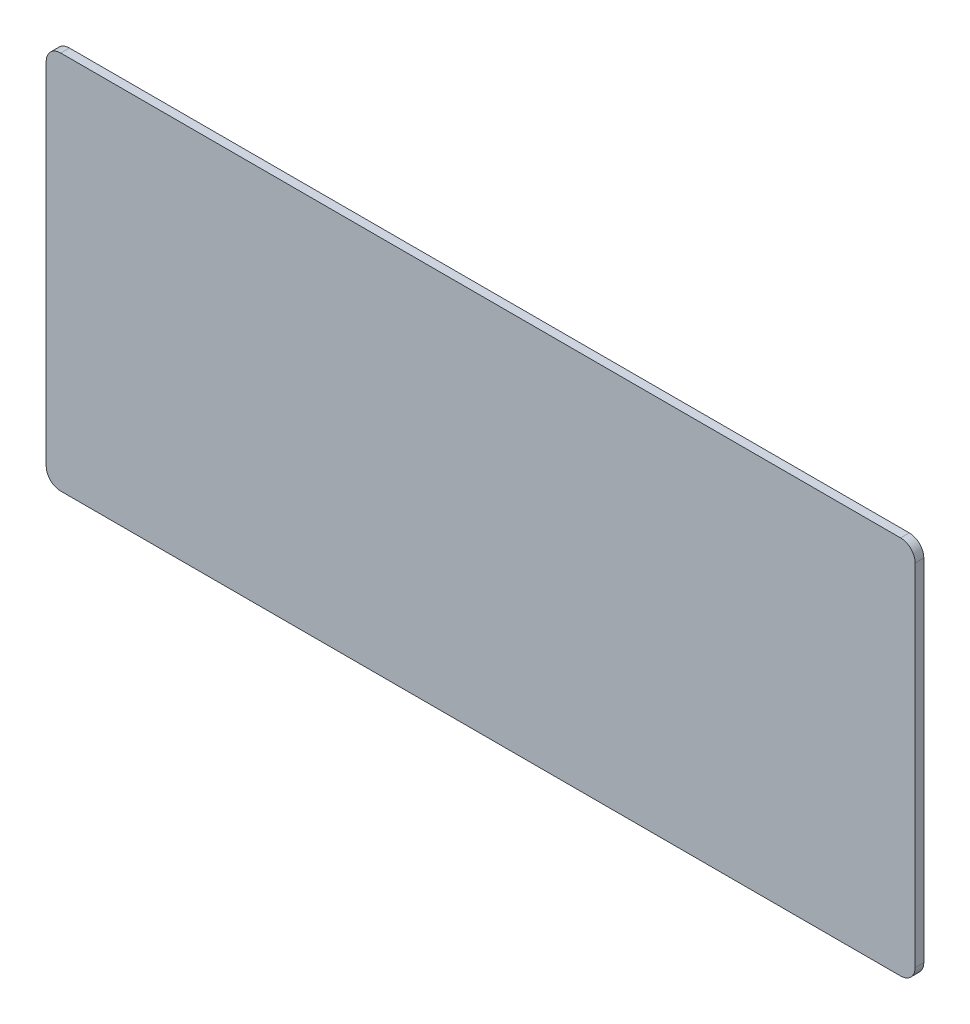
from build123d import *

# Parameters (mm, degrees)
ESBO_O1_W                = 600
ESBO_O1_H                = 250
RESSALTO_EXTRUS_O1_DEPTH = 6
ESBO_O2_W                = 600
ESBO_O2_H                = 6
RESSALTO_EXTRUS_O2_DEPTH = 12
FILETE1_R                = 10


with BuildPart() as part:
    # Esbo_o1 → Ressalto-extrus_o1 (new body)
    with BuildSketch(Plane.XY):
        with Locations((300, -125)):
            Rectangle(ESBO_O1_W, ESBO_O1_H)
    extrude(amount=RESSALTO_EXTRUS_O1_DEPTH)

    # Esbo_o2 → Ressalto-extrus_o2 (add)
    with BuildSketch(Plane.XZ.offset(250)):
        with Locations((300, 3)):
            Rectangle(ESBO_O2_W, ESBO_O2_H)
    extrude(amount=RESSALTO_EXTRUS_O2_DEPTH)

    # Filete1
    filete1_edges = [part.edges().sort_by_distance(p)[0] for p in [
        (0, -262, 3),
        (600, -262, 3),
        (0, 0, 3),
        (600, 0, 3),
    ]]
    fillet(filete1_edges, radius=FILETE1_R)


solid = part.part
